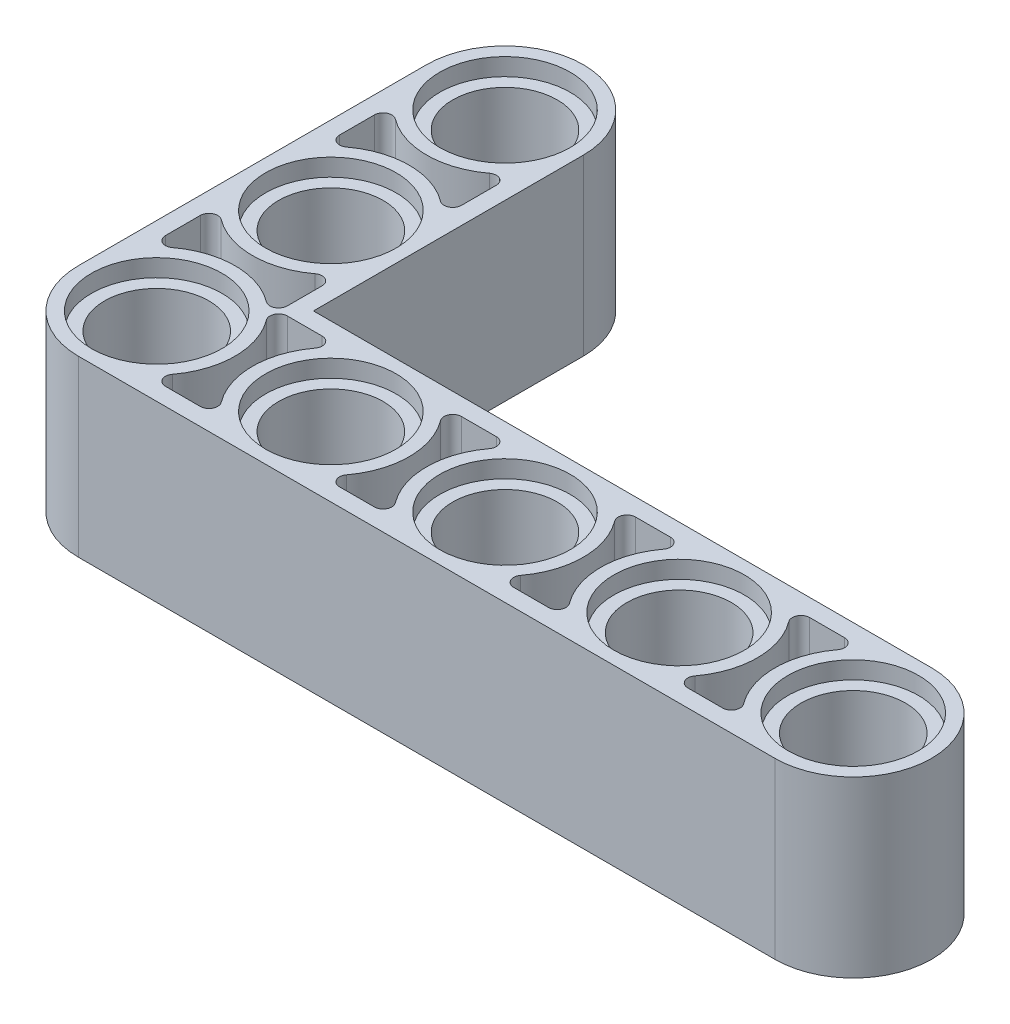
from build123d import *

# Parameters (mm, degrees)
SKETCH1_R           = 2.4
BOSS_EXTRUDE1_DEPTH = 8
SKETCH2_R           = 3
CUT_EXTRUDE1_DEPTH  = 0.8
CUT_EXTRUDE2_START  = -3.6
CUT_EXTRUDE2_DEPTH  = 3.6


with BuildPart() as part:
    # Sketch1 → Boss-Extrude1 (new body)
    with BuildSketch(Plane(origin=(0, 0, 0), x_dir=(1, 0, 0), z_dir=(0, 1, 0))):
        with BuildLine():
            Line((-12.4, 16), (-12.4, 3.6))
            Line((-12.4, 3.6), (16, 3.6))
            ThreePointArc((16, 3.6), (19.6, 0), (16, -3.6))
            Line((16, -3.6), (-16, -3.6))
            ThreePointArc((-16, -3.6), (-18.545584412, -2.545584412), (-19.6, 0))
            Line((-19.6, 0), (-19.6, 16))
            ThreePointArc((-19.6, 16), (-16, 19.6), (-12.4, 16))
        make_face()
        with Locations(Location((0, 0, 0), (0, 0, 270))):
            Circle(SKETCH1_R, mode=Mode.SUBTRACT)
        with Locations(Location((8, 0, 0), (0, 0, 270))):
            Circle(SKETCH1_R, mode=Mode.SUBTRACT)
        with Locations(Location((16, 0, 0), (0, 0, 270))):
            Circle(SKETCH1_R, mode=Mode.SUBTRACT)
        with Locations(Location((-8, 0, 0), (0, 0, 270))):
            Circle(SKETCH1_R, mode=Mode.SUBTRACT)
        with Locations(Location((-16, 0, 0), (0, 0, 270))):
            Circle(SKETCH1_R, mode=Mode.SUBTRACT)
        with Locations(Location((-16, 8, 0), (0, 0, 270))):
            Circle(SKETCH1_R, mode=Mode.SUBTRACT)
        with Locations(Location((-16, 16, 0), (0, 0, 270))):
            Circle(SKETCH1_R, mode=Mode.SUBTRACT)
    extrude(amount=BOSS_EXTRUDE1_DEPTH)

    # Sketch2 → Cut-Extrude1 (cut)
    with BuildSketch(Plane(origin=(0, 8, 0), x_dir=(1, 0, 0), z_dir=(0, 1, 0))):
        with Locations(Location((16, 0, 0), (0, 0, 270))):
            Circle(SKETCH2_R)
        with Locations(Location((8, 0, 0), (0, 0, 270))):
            Circle(SKETCH2_R)
        with Locations(Location((0, 0, 0), (0, 0, 270))):
            Circle(SKETCH2_R)
        with Locations(Location((-8, 0, 0), (0, 0, 270))):
            Circle(SKETCH2_R)
        with Locations(Location((-16, 0, 0), (0, 0, 270))):
            Circle(SKETCH2_R)
        with Locations(Location((-16, 8, 0), (0, 0, 270))):
            Circle(SKETCH2_R)
        with Locations(Location((-16, 16, 0), (0, 0, 270))):
            Circle(SKETCH2_R)
    cut_extrude1 = extrude(amount=-CUT_EXTRUDE1_DEPTH, mode=Mode.SUBTRACT)

    # Mirror1: Cut-Extrude1 across plane
    add(cut_extrude1.mirror(Plane.ZX.offset(4)), mode=Mode.SUBTRACT)

    # Sketch3 → Cut-Extrude2 (cut)
    with BuildSketch(Plane(origin=(0, 8, 0), x_dir=(1, 0, 0), z_dir=(0, 1, 0)).offset(CUT_EXTRUDE2_START)):
        with BuildLine():
            Line((11.2, 2.8), (12.8, 2.8))
            ThreePointArc((12.8, 2.8), (13.157770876, 2.578885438), (13.12, 2.16))
            ThreePointArc((13.12, 2.16), (12.4, 0), (13.12, -2.16))
            ThreePointArc((13.12, -2.16), (13.157770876, -2.578885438), (12.8, -2.8))
            Line((12.8, -2.8), (11.2, -2.8))
            ThreePointArc((11.2, -2.8), (10.842229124, -2.578885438), (10.88, -2.16))
            ThreePointArc((10.88, -2.16), (11.6, 0), (10.88, 2.16))
            ThreePointArc((10.88, 2.16), (10.842229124, 2.578885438), (11.2, 2.8))
        make_face()
        with BuildLine():
            Line((3.2, 2.8), (4.8, 2.8))
            ThreePointArc((4.8, 2.8), (5.157770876, 2.578885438), (5.12, 2.16))
            ThreePointArc((5.12, 2.16), (4.4, 0), (5.12, -2.16))
            ThreePointArc((5.12, -2.16), (5.157770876, -2.578885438), (4.8, -2.8))
            Line((4.8, -2.8), (3.2, -2.8))
            ThreePointArc((3.2, -2.8), (2.842229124, -2.578885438), (2.88, -2.16))
            ThreePointArc((2.88, -2.16), (3.6, 0), (2.88, 2.16))
            ThreePointArc((2.88, 2.16), (2.842229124, 2.578885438), (3.2, 2.8))
        make_face()
        with BuildLine():
            Line((-4.8, 2.8), (-3.2, 2.8))
            ThreePointArc((-3.2, 2.8), (-2.842229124, 2.578885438), (-2.88, 2.16))
            ThreePointArc((-2.88, 2.16), (-3.6, 0), (-2.88, -2.16))
            ThreePointArc((-2.88, -2.16), (-2.842229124, -2.578885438), (-3.2, -2.8))
            Line((-3.2, -2.8), (-4.8, -2.8))
            ThreePointArc((-4.8, -2.8), (-5.157770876, -2.578885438), (-5.12, -2.16))
            ThreePointArc((-5.12, -2.16), (-4.4, 0), (-5.12, 2.16))
            ThreePointArc((-5.12, 2.16), (-5.157770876, 2.578885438), (-4.8, 2.8))
        make_face()
        with BuildLine():
            Line((-12.8, 2.8), (-11.2, 2.8))
            ThreePointArc((-11.2, 2.8), (-10.842229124, 2.578885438), (-10.88, 2.16))
            ThreePointArc((-10.88, 2.16), (-11.6, 0), (-10.88, -2.16))
            ThreePointArc((-10.88, -2.16), (-10.842229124, -2.578885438), (-11.2, -2.8))
            Line((-11.2, -2.8), (-12.8, -2.8))
            ThreePointArc((-12.8, -2.8), (-13.157770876, -2.578885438), (-13.12, -2.16))
            ThreePointArc((-13.12, -2.16), (-12.4, 0), (-13.12, 2.16))
            ThreePointArc((-13.12, 2.16), (-13.157770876, 2.578885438), (-12.8, 2.8))
        make_face()
        with BuildLine():
            Line((-18.8, 3.2), (-18.8, 4.8))
            ThreePointArc((-18.8, 4.8), (-18.578885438, 5.157770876), (-18.16, 5.12))
            ThreePointArc((-18.16, 5.12), (-16, 4.4), (-13.84, 5.12))
            ThreePointArc((-13.84, 5.12), (-13.421114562, 5.157770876), (-13.2, 4.8))
            Line((-13.2, 4.8), (-13.2, 3.2))
            ThreePointArc((-13.2, 3.2), (-13.421114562, 2.842229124), (-13.84, 2.88))
            ThreePointArc((-13.84, 2.88), (-16, 3.6), (-18.16, 2.88))
            ThreePointArc((-18.16, 2.88), (-18.578885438, 2.842229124), (-18.8, 3.2))
        make_face()
        with BuildLine():
            Line((-13.2, 12.8), (-13.2, 11.2))
            ThreePointArc((-13.2, 11.2), (-13.421114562, 10.842229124), (-13.84, 10.88))
            ThreePointArc((-13.84, 10.88), (-16, 11.6), (-18.16, 10.88))
            ThreePointArc((-18.16, 10.88), (-18.578885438, 10.842229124), (-18.8, 11.2))
            Line((-18.8, 11.2), (-18.8, 12.8))
            ThreePointArc((-18.8, 12.8), (-18.578885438, 13.157770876), (-18.16, 13.12))
            ThreePointArc((-18.16, 13.12), (-16, 12.4), (-13.84, 13.12))
            ThreePointArc((-13.84, 13.12), (-13.421114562, 13.157770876), (-13.2, 12.8))
        make_face()
    cut_extrude2 = extrude(amount=CUT_EXTRUDE2_DEPTH, mode=Mode.SUBTRACT)

    # Mirror2: Cut-Extrude2 across plane
    add(cut_extrude2.mirror(Plane.ZX.offset(4)), mode=Mode.SUBTRACT)


solid = part.part
